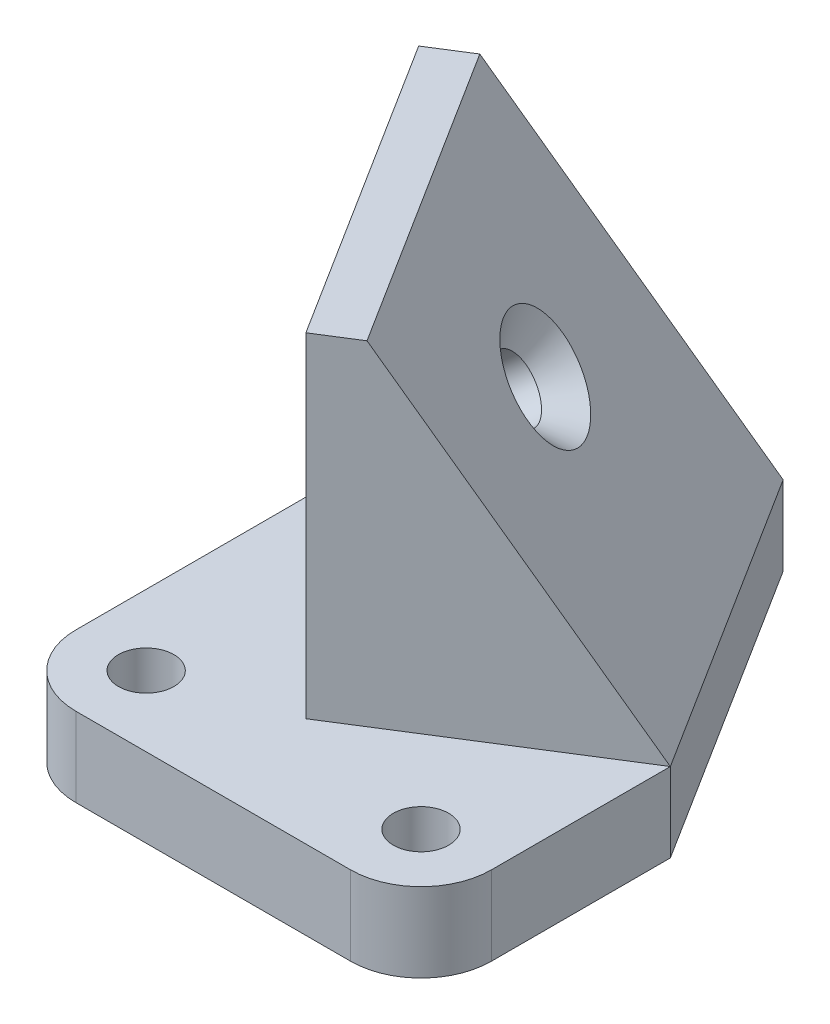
ISO-10303-21;
HEADER;
FILE_DESCRIPTION(('STEP AP214'),'2;1');
FILE_NAME('part.step','',(''),(''),'','','');
FILE_SCHEMA(('AUTOMOTIVE_DESIGN { 1 0 10303 214 1 1 1 1 }'));
ENDSEC;
DATA;
#1=APPLICATION_CONTEXT('core data for automotive mechanical design processes');
#2=APPLICATION_PROTOCOL_DEFINITION('international standard','automotive_design',2000,#1);
#3=PRODUCT_CONTEXT('',#1,'mechanical');
#4=PRODUCT('Part','Part','',(#3));
#5=PRODUCT_RELATED_PRODUCT_CATEGORY('part','',(#4));
#6=PRODUCT_DEFINITION_FORMATION('','',#4);
#7=PRODUCT_DEFINITION_CONTEXT('part definition',#1,'design');
#8=PRODUCT_DEFINITION('design','',#6,#7);
#9=PRODUCT_DEFINITION_SHAPE('','',#8);
#10=(LENGTH_UNIT() NAMED_UNIT(*) SI_UNIT(.MILLI.,.METRE.));
#11=(NAMED_UNIT(*) PLANE_ANGLE_UNIT() SI_UNIT($,.RADIAN.));
#12=(NAMED_UNIT(*) SI_UNIT($,.STERADIAN.) SOLID_ANGLE_UNIT());
#13=UNCERTAINTY_MEASURE_WITH_UNIT(LENGTH_MEASURE(1.E-05),#10,'distance_accuracy_value','');
#14=(GEOMETRIC_REPRESENTATION_CONTEXT(3) GLOBAL_UNCERTAINTY_ASSIGNED_CONTEXT((#13)) GLOBAL_UNIT_ASSIGNED_CONTEXT((#10,
#11,#12)) REPRESENTATION_CONTEXT('',''));
#15=CARTESIAN_POINT('',(0.,0.,0.));
#16=DIRECTION('',(0.,0.,1.));
#17=DIRECTION('',(1.,0.,0.));
#18=AXIS2_PLACEMENT_3D('',#15,#16,#17);
#19=CARTESIAN_POINT('',(0.,14.2875,-45.));
#20=DIRECTION('',(-0.846153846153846,0.,0.532938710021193));
#21=DIRECTION('',(0.532938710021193,0.,0.846153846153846));
#22=AXIS2_PLACEMENT_3D('',#19,#20,#21);
#23=PLANE('',#22);
#24=DIRECTION('',(-0.532938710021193,0.,-0.846153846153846));
#25=VECTOR('',#24,1.);
#26=CARTESIAN_POINT('',(0.,14.2875,-45.));
#27=LINE('',#26,#25);
#28=CARTESIAN_POINT('',(0.,14.2875,-45.));
#29=VERTEX_POINT('',#28);
#30=CARTESIAN_POINT('',(-34.6410161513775,14.2875,-100.));
#31=VERTEX_POINT('',#30);
#32=EDGE_CURVE('E291',#29,#31,#27,.T.);
#33=ORIENTED_EDGE('',*,*,#32,.F.);
#34=DIRECTION('',(0.,-1.,0.));
#35=VECTOR('',#34,1.);
#36=CARTESIAN_POINT('',(0.,14.2875,-45.));
#37=LINE('',#36,#35);
#38=CARTESIAN_POINT('',(0.,0.,-45.));
#39=VERTEX_POINT('',#38);
#40=EDGE_CURVE('E144',#29,#39,#37,.T.);
#41=ORIENTED_EDGE('',*,*,#40,.T.);
#42=DIRECTION('',(-0.532938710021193,0.,-0.846153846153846));
#43=VECTOR('',#42,1.);
#44=CARTESIAN_POINT('',(0.,0.,-45.));
#45=LINE('',#44,#43);
#46=CARTESIAN_POINT('',(-34.6410161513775,0.,-100.));
#47=VERTEX_POINT('',#46);
#48=EDGE_CURVE('E237',#39,#47,#45,.T.);
#49=ORIENTED_EDGE('',*,*,#48,.T.);
#50=DIRECTION('',(0.,-1.,0.));
#51=VECTOR('',#50,1.);
#52=CARTESIAN_POINT('',(-34.6410161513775,14.2875,-100.));
#53=LINE('',#52,#51);
#54=EDGE_CURVE('E150',#31,#47,#53,.T.);
#55=ORIENTED_EDGE('',*,*,#54,.F.);
#56=EDGE_LOOP('',(#33,#41,#49,#55));
#57=FACE_BOUND('',#56,.T.);
#58=ADVANCED_FACE('F41',(#57),#23,.F.);
#59=CARTESIAN_POINT('',(-34.6410161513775,14.2875,-100.));
#60=DIRECTION('',(0.532938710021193,0.,0.846153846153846));
#61=DIRECTION('',(0.846153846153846,0.,-0.532938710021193));
#62=AXIS2_PLACEMENT_3D('',#59,#60,#61);
#63=PLANE('',#62);
#64=DIRECTION('',(-0.46513764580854,0.835356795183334,0.292960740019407));
#65=VECTOR('',#64,1.);
#66=CARTESIAN_POINT('',(-34.6410161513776,14.2875,-100.));
#67=LINE('',#66,#65);
#68=CARTESIAN_POINT('',(-68.2307692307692,74.6125,-78.8439422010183));
#69=VERTEX_POINT('',#68);
#70=EDGE_CURVE('E298',#31,#69,#67,.T.);
#71=ORIENTED_EDGE('',*,*,#70,.F.);
#72=ORIENTED_EDGE('',*,*,#54,.T.);
#73=DIRECTION('',(-0.846153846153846,0.,0.532938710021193));
#74=VECTOR('',#73,1.);
#75=CARTESIAN_POINT('',(-34.6410161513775,0.,-100.));
#76=LINE('',#75,#74);
#77=CARTESIAN_POINT('',(-75.,0.,-74.5804325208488));
#78=VERTEX_POINT('',#77);
#79=EDGE_CURVE('E242',#47,#78,#76,.T.);
#80=ORIENTED_EDGE('',*,*,#79,.T.);
#81=DIRECTION('',(0.,-1.,0.));
#82=VECTOR('',#81,1.);
#83=CARTESIAN_POINT('',(-75.,14.2875,-74.5804325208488));
#84=LINE('',#83,#82);
#85=CARTESIAN_POINT('',(-75.,14.2875,-74.5804325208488));
#86=VERTEX_POINT('',#85);
#87=EDGE_CURVE('E151',#86,#78,#84,.T.);
#88=ORIENTED_EDGE('',*,*,#87,.F.);
#89=DIRECTION('',(0.,-1.,0.));
#90=VECTOR('',#89,1.);
#91=CARTESIAN_POINT('',(-75.,74.6125,-74.5804325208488));
#92=LINE('',#91,#90);
#93=CARTESIAN_POINT('',(-75.,74.6125,-74.5804325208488));
#94=VERTEX_POINT('',#93);
#95=EDGE_CURVE('E260',#94,#86,#92,.T.);
#96=ORIENTED_EDGE('',*,*,#95,.F.);
#97=DIRECTION('',(-0.846153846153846,0.,0.532938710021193));
#98=VECTOR('',#97,1.);
#99=CARTESIAN_POINT('',(-34.6410161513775,74.6125,-100.));
#100=LINE('',#99,#98);
#101=EDGE_CURVE('E310',#69,#94,#100,.T.);
#102=ORIENTED_EDGE('',*,*,#101,.F.);
#103=EDGE_LOOP('',(#71,#72,#80,#88,#96,#102));
#104=FACE_BOUND('',#103,.T.);
#105=ADVANCED_FACE('F186',(#104),#63,.F.);
#106=CARTESIAN_POINT('',(0.,74.6125,-45.));
#107=DIRECTION('',(0.532938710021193,0.,0.846153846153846));
#108=DIRECTION('',(0.846153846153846,0.,-0.532938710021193));
#109=AXIS2_PLACEMENT_3D('',#106,#107,#108);
#110=PLANE('',#109);
#111=DIRECTION('',(-0.846153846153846,0.,0.532938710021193));
#112=VECTOR('',#111,1.);
#113=CARTESIAN_POINT('',(0.,14.2875,-45.));
#114=LINE('',#113,#112);
#115=CARTESIAN_POINT('',(-40.3589838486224,14.2875,-19.5804325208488));
#116=VERTEX_POINT('',#115);
#117=EDGE_CURVE('E297',#29,#116,#114,.T.);
#118=ORIENTED_EDGE('',*,*,#117,.F.);
#119=DIRECTION('',(0.46513764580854,-0.835356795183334,-0.292960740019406));
#120=VECTOR('',#119,1.);
#121=CARTESIAN_POINT('',(-33.5897530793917,74.6125,-23.8439422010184));
#122=LINE('',#121,#120);
#123=CARTESIAN_POINT('',(-33.5897530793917,74.6125,-23.8439422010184));
#124=VERTEX_POINT('',#123);
#125=EDGE_CURVE('E286',#124,#29,#122,.T.);
#126=ORIENTED_EDGE('',*,*,#125,.F.);
#127=DIRECTION('',(-0.846153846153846,0.,0.532938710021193));
#128=VECTOR('',#127,1.);
#129=CARTESIAN_POINT('',(0.,74.6125,-45.));
#130=LINE('',#129,#128);
#131=CARTESIAN_POINT('',(-40.3589838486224,74.6125,-19.5804325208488));
#132=VERTEX_POINT('',#131);
#133=EDGE_CURVE('E301',#124,#132,#130,.T.);
#134=ORIENTED_EDGE('',*,*,#133,.T.);
#135=DIRECTION('',(0.,-1.,0.));
#136=VECTOR('',#135,1.);
#137=CARTESIAN_POINT('',(-40.3589838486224,74.6125,-19.5804325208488));
#138=LINE('',#137,#136);
#139=EDGE_CURVE('E307',#132,#116,#138,.T.);
#140=ORIENTED_EDGE('',*,*,#139,.T.);
#141=EDGE_LOOP('',(#118,#126,#134,#140));
#142=FACE_BOUND('',#141,.T.);
#143=ADVANCED_FACE('F177',(#142),#110,.T.);
#144=CARTESIAN_POINT('',(0.,74.6125,-45.));
#145=DIRECTION('',(0.,-1.,0.));
#146=DIRECTION('',(0.,0.,-1.));
#147=AXIS2_PLACEMENT_3D('',#144,#145,#146);
#148=PLANE('',#147);
#149=DIRECTION('',(-0.532938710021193,0.,-0.846153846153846));
#150=VECTOR('',#149,1.);
#151=CARTESIAN_POINT('',(-33.5897530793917,74.6125,-23.8439422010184));
#152=LINE('',#151,#150);
#153=EDGE_CURVE('E290',#124,#69,#152,.T.);
#154=ORIENTED_EDGE('',*,*,#153,.T.);
#155=ORIENTED_EDGE('',*,*,#101,.T.);
#156=DIRECTION('',(0.532938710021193,0.,0.846153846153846));
#157=VECTOR('',#156,1.);
#158=CARTESIAN_POINT('',(-75.,74.6125,-74.5804325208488));
#159=LINE('',#158,#157);
#160=EDGE_CURVE('E303',#94,#132,#159,.T.);
#161=ORIENTED_EDGE('',*,*,#160,.T.);
#162=ORIENTED_EDGE('',*,*,#133,.F.);
#163=EDGE_LOOP('',(#154,#155,#161,#162));
#164=FACE_BOUND('',#163,.T.);
#165=ADVANCED_FACE('F176',(#164),#148,.F.);
#166=CARTESIAN_POINT('',(0.,14.2875,0.));
#167=DIRECTION('',(0.,0.,1.));
#168=DIRECTION('',(1.,0.,0.));
#169=AXIS2_PLACEMENT_3D('',#166,#167,#168);
#170=PLANE('',#169);
#171=DIRECTION('',(-1.,0.,0.));
#172=VECTOR('',#171,1.);
#173=CARTESIAN_POINT('',(0.,0.,0.));
#174=LINE('',#173,#172);
#175=CARTESIAN_POINT('',(-12.7,0.,0.));
#176=VERTEX_POINT('',#175);
#177=CARTESIAN_POINT('',(-62.3,0.,0.));
#178=VERTEX_POINT('',#177);
#179=EDGE_CURVE('E251',#176,#178,#174,.T.);
#180=ORIENTED_EDGE('',*,*,#179,.F.);
#181=DIRECTION('',(0.,-1.,0.));
#182=VECTOR('',#181,1.);
#183=CARTESIAN_POINT('',(-12.7,14.2875,0.));
#184=LINE('',#183,#182);
#185=CARTESIAN_POINT('',(-12.7,14.2875,0.));
#186=VERTEX_POINT('',#185);
#187=EDGE_CURVE('E214',#176,#186,#184,.F.);
#188=ORIENTED_EDGE('',*,*,#187,.T.);
#189=DIRECTION('',(-1.,0.,0.));
#190=VECTOR('',#189,1.);
#191=CARTESIAN_POINT('',(0.,14.2875,0.));
#192=LINE('',#191,#190);
#193=CARTESIAN_POINT('',(-62.3,14.2875,0.));
#194=VERTEX_POINT('',#193);
#195=EDGE_CURVE('E239',#186,#194,#192,.T.);
#196=ORIENTED_EDGE('',*,*,#195,.T.);
#197=DIRECTION('',(0.,-1.,0.));
#198=VECTOR('',#197,1.);
#199=CARTESIAN_POINT('',(-62.3,14.2875,0.));
#200=LINE('',#199,#198);
#201=EDGE_CURVE('E223',#194,#178,#200,.T.);
#202=ORIENTED_EDGE('',*,*,#201,.T.);
#203=EDGE_LOOP('',(#180,#188,#196,#202));
#204=FACE_BOUND('',#203,.T.);
#205=ADVANCED_FACE('F178',(#204),#170,.T.);
#206=CARTESIAN_POINT('',(0.,14.2875,0.));
#207=DIRECTION('',(-1.,0.,0.));
#208=DIRECTION('',(0.,0.,1.));
#209=AXIS2_PLACEMENT_3D('',#206,#207,#208);
#210=PLANE('',#209);
#211=DIRECTION('',(0.,0.,-1.));
#212=VECTOR('',#211,1.);
#213=CARTESIAN_POINT('',(0.,14.2875,0.));
#214=LINE('',#213,#212);
#215=CARTESIAN_POINT('',(0.,14.2875,-12.7));
#216=VERTEX_POINT('',#215);
#217=EDGE_CURVE('E233',#216,#29,#214,.T.);
#218=ORIENTED_EDGE('',*,*,#217,.F.);
#219=DIRECTION('',(0.,-1.,0.));
#220=VECTOR('',#219,1.);
#221=CARTESIAN_POINT('',(0.,0.,-12.7));
#222=LINE('',#221,#220);
#223=CARTESIAN_POINT('',(0.,0.,-12.7));
#224=VERTEX_POINT('',#223);
#225=EDGE_CURVE('E139',#216,#224,#222,.T.);
#226=ORIENTED_EDGE('',*,*,#225,.T.);
#227=DIRECTION('',(0.,0.,-1.));
#228=VECTOR('',#227,1.);
#229=CARTESIAN_POINT('',(0.,0.,0.));
#230=LINE('',#229,#228);
#231=EDGE_CURVE('E229',#224,#39,#230,.T.);
#232=ORIENTED_EDGE('',*,*,#231,.T.);
#233=ORIENTED_EDGE('',*,*,#40,.F.);
#234=EDGE_LOOP('',(#218,#226,#232,#233));
#235=FACE_BOUND('',#234,.T.);
#236=ADVANCED_FACE('F187',(#235),#210,.F.);
#237=CARTESIAN_POINT('',(-75.,14.2875,0.));
#238=DIRECTION('',(-1.,0.,0.));
#239=DIRECTION('',(0.,0.,1.));
#240=AXIS2_PLACEMENT_3D('',#237,#238,#239);
#241=PLANE('',#240);
#242=DIRECTION('',(0.,0.,-1.));
#243=VECTOR('',#242,1.);
#244=CARTESIAN_POINT('',(-75.,0.,0.));
#245=LINE('',#244,#243);
#246=CARTESIAN_POINT('',(-75.,0.,-12.7));
#247=VERTEX_POINT('',#246);
#248=EDGE_CURVE('E256',#247,#78,#245,.T.);
#249=ORIENTED_EDGE('',*,*,#248,.F.);
#250=DIRECTION('',(0.,-1.,0.));
#251=VECTOR('',#250,1.);
#252=CARTESIAN_POINT('',(-75.,14.2875,-12.7));
#253=LINE('',#252,#251);
#254=CARTESIAN_POINT('',(-75.,14.2875,-12.7));
#255=VERTEX_POINT('',#254);
#256=EDGE_CURVE('E11',#247,#255,#253,.F.);
#257=ORIENTED_EDGE('',*,*,#256,.T.);
#258=DIRECTION('',(0.,0.,-1.));
#259=VECTOR('',#258,1.);
#260=CARTESIAN_POINT('',(-75.,14.2875,0.));
#261=LINE('',#260,#259);
#262=EDGE_CURVE('E245',#255,#86,#261,.T.);
#263=ORIENTED_EDGE('',*,*,#262,.T.);
#264=ORIENTED_EDGE('',*,*,#87,.T.);
#265=EDGE_LOOP('',(#249,#257,#263,#264));
#266=FACE_BOUND('',#265,.T.);
#267=ADVANCED_FACE('F201',(#266),#241,.T.);
#268=CARTESIAN_POINT('',(0.,14.2875,0.));
#269=DIRECTION('',(0.,-1.,0.));
#270=DIRECTION('',(0.,0.,-1.));
#271=AXIS2_PLACEMENT_3D('',#268,#269,#270);
#272=PLANE('',#271);
#273=CARTESIAN_POINT('',(-12.7,14.2875,-12.7));
#274=DIRECTION('',(0.,1.,0.));
#275=DIRECTION('',(0.,0.,1.));
#276=AXIS2_PLACEMENT_3D('',#273,#274,#275);
#277=CIRCLE('',#276,4.99999999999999);
#278=CARTESIAN_POINT('',(-12.7,14.2875,-7.70000000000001));
#279=VERTEX_POINT('',#278);
#280=EDGE_CURVE('E272',#279,#279,#277,.T.);
#281=ORIENTED_EDGE('',*,*,#280,.F.);
#282=EDGE_LOOP('',(#281));
#283=FACE_BOUND('',#282,.T.);
#284=CARTESIAN_POINT('',(-62.3,14.2875,-12.7));
#285=DIRECTION('',(0.,1.,0.));
#286=DIRECTION('',(0.,0.,1.));
#287=AXIS2_PLACEMENT_3D('',#284,#285,#286);
#288=CIRCLE('',#287,4.99999999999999);
#289=CARTESIAN_POINT('',(-62.3,14.2875,-7.7));
#290=VERTEX_POINT('',#289);
#291=EDGE_CURVE('E274',#290,#290,#288,.T.);
#292=ORIENTED_EDGE('',*,*,#291,.F.);
#293=EDGE_LOOP('',(#292));
#294=FACE_BOUND('',#293,.T.);
#295=ORIENTED_EDGE('',*,*,#195,.F.);
#296=CARTESIAN_POINT('',(-12.7,14.2875,-12.7));
#297=DIRECTION('',(0.,-1.,0.));
#298=DIRECTION('',(0.,0.,-1.));
#299=AXIS2_PLACEMENT_3D('',#296,#297,#298);
#300=CIRCLE('',#299,12.7);
#301=EDGE_CURVE('E47',#186,#216,#300,.F.);
#302=ORIENTED_EDGE('',*,*,#301,.T.);
#303=ORIENTED_EDGE('',*,*,#217,.T.);
#304=ORIENTED_EDGE('',*,*,#117,.T.);
#305=DIRECTION('',(0.532938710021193,0.,0.846153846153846));
#306=VECTOR('',#305,1.);
#307=CARTESIAN_POINT('',(-75.,14.2875,-74.5804325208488));
#308=LINE('',#307,#306);
#309=EDGE_CURVE('E302',#86,#116,#308,.T.);
#310=ORIENTED_EDGE('',*,*,#309,.F.);
#311=ORIENTED_EDGE('',*,*,#262,.F.);
#312=CARTESIAN_POINT('',(-62.3,14.2875,-12.7));
#313=DIRECTION('',(0.,-1.,0.));
#314=DIRECTION('',(0.,0.,-1.));
#315=AXIS2_PLACEMENT_3D('',#312,#313,#314);
#316=CIRCLE('',#315,12.7);
#317=EDGE_CURVE('E61',#255,#194,#316,.F.);
#318=ORIENTED_EDGE('',*,*,#317,.T.);
#319=EDGE_LOOP('',(#295,#302,#303,#304,#310,#311,#318));
#320=FACE_BOUND('',#319,.T.);
#321=ADVANCED_FACE('F204',(#283,#294,#320),#272,.F.);
#322=CARTESIAN_POINT('',(0.,0.,0.));
#323=DIRECTION('',(0.,-1.,0.));
#324=DIRECTION('',(0.,0.,-1.));
#325=AXIS2_PLACEMENT_3D('',#322,#323,#324);
#326=PLANE('',#325);
#327=CARTESIAN_POINT('',(-12.7,0.,-12.7));
#328=DIRECTION('',(0.,1.,0.));
#329=DIRECTION('',(0.,0.,1.));
#330=AXIS2_PLACEMENT_3D('',#327,#328,#329);
#331=CIRCLE('',#330,5.);
#332=CARTESIAN_POINT('',(-12.7,0.,-7.7));
#333=VERTEX_POINT('',#332);
#334=EDGE_CURVE('E276',#333,#333,#331,.T.);
#335=ORIENTED_EDGE('',*,*,#334,.T.);
#336=EDGE_LOOP('',(#335));
#337=FACE_BOUND('',#336,.T.);
#338=CARTESIAN_POINT('',(-62.3,0.,-12.7));
#339=DIRECTION('',(0.,1.,0.));
#340=DIRECTION('',(0.,0.,1.));
#341=AXIS2_PLACEMENT_3D('',#338,#339,#340);
#342=CIRCLE('',#341,5.);
#343=CARTESIAN_POINT('',(-62.3,0.,-7.69999999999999));
#344=VERTEX_POINT('',#343);
#345=EDGE_CURVE('E138',#344,#344,#342,.T.);
#346=ORIENTED_EDGE('',*,*,#345,.T.);
#347=EDGE_LOOP('',(#346));
#348=FACE_BOUND('',#347,.T.);
#349=ORIENTED_EDGE('',*,*,#231,.F.);
#350=CARTESIAN_POINT('',(-12.7,0.,-12.7));
#351=DIRECTION('',(0.,-1.,0.));
#352=DIRECTION('',(0.,0.,-1.));
#353=AXIS2_PLACEMENT_3D('',#350,#351,#352);
#354=CIRCLE('',#353,12.7);
#355=EDGE_CURVE('E225',#224,#176,#354,.T.);
#356=ORIENTED_EDGE('',*,*,#355,.T.);
#357=ORIENTED_EDGE('',*,*,#179,.T.);
#358=CARTESIAN_POINT('',(-62.3,0.,-12.7));
#359=DIRECTION('',(0.,-1.,0.));
#360=DIRECTION('',(0.,0.,-1.));
#361=AXIS2_PLACEMENT_3D('',#358,#359,#360);
#362=CIRCLE('',#361,12.7);
#363=EDGE_CURVE('E228',#178,#247,#362,.T.);
#364=ORIENTED_EDGE('',*,*,#363,.T.);
#365=ORIENTED_EDGE('',*,*,#248,.T.);
#366=ORIENTED_EDGE('',*,*,#79,.F.);
#367=ORIENTED_EDGE('',*,*,#48,.F.);
#368=EDGE_LOOP('',(#349,#356,#357,#364,#365,#366,#367));
#369=FACE_BOUND('',#368,.T.);
#370=ADVANCED_FACE('F234',(#337,#348,#369),#326,.T.);
#371=CARTESIAN_POINT('',(-75.,74.6125,-74.5804325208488));
#372=DIRECTION('',(0.846153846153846,0.,-0.532938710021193));
#373=DIRECTION('',(-0.532938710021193,0.,-0.846153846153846));
#374=AXIS2_PLACEMENT_3D('',#371,#372,#373);
#375=PLANE('',#374);
#376=CARTESIAN_POINT('',(-56.739118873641,40.5834786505,-45.5873897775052));
#377=CARTESIAN_POINT('',(-56.7606127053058,40.5376919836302,-45.6215158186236));
#378=CARTESIAN_POINT('',(-56.7832772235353,40.4923245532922,-45.657500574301));
#379=CARTESIAN_POINT('',(-56.8327758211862,40.4073182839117,-45.7360901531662));
#380=CARTESIAN_POINT('',(-56.8597228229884,40.367917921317,-45.7788742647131));
#381=CARTESIAN_POINT('',(-56.901423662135,40.322170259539,-45.8450832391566));
#382=CARTESIAN_POINT('',(-56.9142389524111,40.3098705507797,-45.8654302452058));
#383=CARTESIAN_POINT('',(-56.9406235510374,40.2889971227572,-45.9073214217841));
#384=CARTESIAN_POINT('',(-56.9541872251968,40.280398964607,-45.9288566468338));
#385=CARTESIAN_POINT('',(-56.9821274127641,40.267702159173,-45.97321765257));
#386=CARTESIAN_POINT('',(-56.9965126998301,40.2636687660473,-45.9960573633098));
#387=CARTESIAN_POINT('',(-57.0254372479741,40.260983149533,-46.041981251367));
#388=CARTESIAN_POINT('',(-57.0399765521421,40.2623324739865,-46.0650654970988));
#389=CARTESIAN_POINT('',(-57.0668925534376,40.2696956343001,-46.1078003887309));
#390=CARTESIAN_POINT('',(-57.0793174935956,40.2751232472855,-46.1275276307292));
#391=CARTESIAN_POINT('',(-57.1036035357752,40.2893347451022,-46.1660869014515));
#392=CARTESIAN_POINT('',(-57.1154642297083,40.298121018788,-46.1849182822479));
#393=CARTESIAN_POINT('',(-57.1469502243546,40.3257198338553,-46.234909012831));
#394=CARTESIAN_POINT('',(-57.16591128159,40.3471658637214,-46.2650137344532));
#395=CARTESIAN_POINT('',(-57.2020266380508,40.3949911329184,-46.3223545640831));
#396=CARTESIAN_POINT('',(-57.2191703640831,40.4213970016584,-46.3495738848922));
#397=CARTESIAN_POINT('',(-57.2479208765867,40.4703833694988,-46.3952214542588));
#398=CARTESIAN_POINT('',(-57.2598525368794,40.4923077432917,-46.4141655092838));
#399=CARTESIAN_POINT('',(-57.2828646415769,40.5371836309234,-46.4507021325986));
#400=CARTESIAN_POINT('',(-57.293953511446,40.5601198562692,-46.4683080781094));
#401=CARTESIAN_POINT('',(-57.3047628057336,40.5834786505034,-46.4854701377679));
#402=B_SPLINE_CURVE_WITH_KNOTS('',3,(#376,#377,#378,#379,#380,#381,#382,#383,#384,#385,#386,
#387,#388,#389,#390,#391,#392,#393,#394,#395,#396,#397,#398,#399,#400,#401),.UNSPECIFIED.,.F.,
.F.,(4,2,2,2,2,2,2,2,2,2,2,2,4),(0.,0.184942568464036,0.375988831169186,0.456775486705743,
0.537020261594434,0.61839820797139,0.699799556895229,0.771317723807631,0.842886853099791,
0.966790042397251,1.09137853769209,1.18532929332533,1.2781644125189),.UNSPECIFIED.);
#403=CARTESIAN_POINT('',(-56.7485935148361,40.5632569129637,-45.6024327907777));
#404=VERTEX_POINT('',#403);
#405=CARTESIAN_POINT('',(-57.2952881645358,40.5632569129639,-46.4704271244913));
#406=VERTEX_POINT('',#405);
#407=EDGE_CURVE('E132',#404,#406,#402,.T.);
#408=ORIENTED_EDGE('',*,*,#407,.T.);
#409=CARTESIAN_POINT('',(-57.0219408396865,34.0079357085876,-46.0364299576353));
#410=DIRECTION('',(0.846153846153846,0.,-0.532938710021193));
#411=DIRECTION('',(0.,1.,0.));
#412=AXIS2_PLACEMENT_3D('',#409,#410,#411);
#413=ELLIPSE('',#412,6.58401300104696,5.49999999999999);
#414=EDGE_CURVE('E136',#406,#404,#413,.T.);
#415=ORIENTED_EDGE('',*,*,#414,.T.);
#416=EDGE_LOOP('',(#408,#415));
#417=FACE_BOUND('',#416,.T.);
#418=ORIENTED_EDGE('',*,*,#309,.T.);
#419=ORIENTED_EDGE('',*,*,#139,.F.);
#420=ORIENTED_EDGE('',*,*,#160,.F.);
#421=ORIENTED_EDGE('',*,*,#95,.T.);
#422=EDGE_LOOP('',(#418,#419,#420,#421));
#423=FACE_BOUND('',#422,.T.);
#424=ADVANCED_FACE('F145',(#417,#423),#375,.F.);
#425=CARTESIAN_POINT('',(-33.5897530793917,74.6125,-23.8439422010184));
#426=DIRECTION('',(0.706840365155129,0.549708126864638,-0.445193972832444));
#427=DIRECTION('',(-0.613901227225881,0.789382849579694,0.));
#428=AXIS2_PLACEMENT_3D('',#425,#426,#427);
#429=PLANE('',#428);
#430=CARTESIAN_POINT('',(-36.5210868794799,49.951402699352,-58.9486192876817));
#431=DIRECTION('',(0.706840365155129,0.549708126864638,-0.445193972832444));
#432=DIRECTION('',(-0.613901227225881,0.789382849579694,0.));
#433=AXIS2_PLACEMENT_3D('',#430,#431,#432);
#434=CIRCLE('',#433,10.);
#435=CARTESIAN_POINT('',(-42.6600991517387,57.845231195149,-58.9486192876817));
#436=VERTEX_POINT('',#435);
#437=EDGE_CURVE('E288',#436,#436,#434,.T.);
#438=ORIENTED_EDGE('',*,*,#437,.F.);
#439=EDGE_LOOP('',(#438));
#440=FACE_BOUND('',#439,.T.);
#441=ORIENTED_EDGE('',*,*,#32,.T.);
#442=ORIENTED_EDGE('',*,*,#70,.T.);
#443=ORIENTED_EDGE('',*,*,#153,.F.);
#444=ORIENTED_EDGE('',*,*,#125,.T.);
#445=EDGE_LOOP('',(#441,#442,#443,#444));
#446=FACE_BOUND('',#445,.T.);
#447=ADVANCED_FACE('F166',(#440,#446),#429,.T.);
#448=CARTESIAN_POINT('',(-36.5210868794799,49.951402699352,-58.9486192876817));
#449=DIRECTION('',(0.706840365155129,0.549708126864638,-0.445193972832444));
#450=DIRECTION('',(-0.613901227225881,0.789382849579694,0.));
#451=AXIS2_PLACEMENT_3D('',#448,#449,#450);
#452=CYLINDRICAL_SURFACE('',#451,5.49999999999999);
#453=CARTESIAN_POINT('',(-39.701868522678,47.4777161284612,-56.9452464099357));
#454=DIRECTION('',(0.706840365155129,0.549708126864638,-0.445193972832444));
#455=DIRECTION('',(-0.613901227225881,0.789382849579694,0.));
#456=AXIS2_PLACEMENT_3D('',#453,#454,#455);
#457=CIRCLE('',#456,5.5);
#458=CARTESIAN_POINT('',(-43.0783252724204,51.8193218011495,-56.9452464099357));
#459=VERTEX_POINT('',#458);
#460=EDGE_CURVE('E135',#459,#459,#457,.T.);
#461=ORIENTED_EDGE('',*,*,#460,.T.);
#462=EDGE_LOOP('',(#461));
#463=FACE_BOUND('',#462,.T.);
#464=CARTESIAN_POINT('',(-54.4748321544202,35.9888162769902,-47.6406923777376));
#465=DIRECTION('',(0.706840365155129,0.549708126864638,-0.445193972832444));
#466=DIRECTION('',(-0.613901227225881,0.789382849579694,0.));
#467=AXIS2_PLACEMENT_3D('',#464,#465,#466);
#468=CIRCLE('',#467,5.5);
#469=EDGE_CURVE('E128',#404,#406,#468,.T.);
#470=ORIENTED_EDGE('',*,*,#469,.F.);
#471=ORIENTED_EDGE('',*,*,#414,.F.);
#472=EDGE_LOOP('',(#470,#471));
#473=FACE_BOUND('',#472,.T.);
#474=ADVANCED_FACE('F126',(#463,#473),#452,.F.);
#475=CARTESIAN_POINT('',(-54.4748321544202,35.9888162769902,-47.6406923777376));
#476=DIRECTION('',(0.706840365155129,0.549708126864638,-0.445193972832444));
#477=DIRECTION('',(-0.613901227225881,0.789382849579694,0.));
#478=AXIS2_PLACEMENT_3D('',#475,#476,#477);
#479=CONICAL_SURFACE('',#478,5.49999999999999,1.02974425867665);
#480=CARTESIAN_POINT('',(-56.8107511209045,34.1721774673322,-46.1694449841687));
#481=VERTEX_POINT('',#480);
#482=VERTEX_LOOP('',#481);
#483=FACE_BOUND('',#482,.T.);
#484=ORIENTED_EDGE('',*,*,#469,.T.);
#485=ORIENTED_EDGE('',*,*,#407,.F.);
#486=EDGE_LOOP('',(#484,#485));
#487=FACE_BOUND('',#486,.T.);
#488=ADVANCED_FACE('F125',(#483,#487),#479,.F.);
#489=CARTESIAN_POINT('',(-36.5210868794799,49.951402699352,-58.9486192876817));
#490=DIRECTION('',(0.706840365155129,0.549708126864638,-0.445193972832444));
#491=DIRECTION('',(-0.613901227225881,0.789382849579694,0.));
#492=AXIS2_PLACEMENT_3D('',#489,#490,#491);
#493=CONICAL_SURFACE('',#492,10.,0.785398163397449);
#494=ORIENTED_EDGE('',*,*,#460,.F.);
#495=EDGE_LOOP('',(#494));
#496=FACE_BOUND('',#495,.T.);
#497=ORIENTED_EDGE('',*,*,#437,.T.);
#498=EDGE_LOOP('',(#497));
#499=FACE_BOUND('',#498,.T.);
#500=ADVANCED_FACE('F123',(#496,#499),#493,.F.);
#501=CARTESIAN_POINT('',(-12.7,14.2875,-12.7));
#502=DIRECTION('',(0.,1.,0.));
#503=DIRECTION('',(0.,0.,1.));
#504=AXIS2_PLACEMENT_3D('',#501,#502,#503);
#505=CYLINDRICAL_SURFACE('',#504,12.7);
#506=ORIENTED_EDGE('',*,*,#301,.F.);
#507=ORIENTED_EDGE('',*,*,#187,.F.);
#508=ORIENTED_EDGE('',*,*,#355,.F.);
#509=ORIENTED_EDGE('',*,*,#225,.F.);
#510=EDGE_LOOP('',(#506,#507,#508,#509));
#511=FACE_BOUND('',#510,.T.);
#512=ADVANCED_FACE('F175',(#511),#505,.T.);
#513=CARTESIAN_POINT('',(-62.3,14.2875,-12.7));
#514=DIRECTION('',(0.,-1.,0.));
#515=DIRECTION('',(0.,0.,-1.));
#516=AXIS2_PLACEMENT_3D('',#513,#514,#515);
#517=CYLINDRICAL_SURFACE('',#516,12.7);
#518=ORIENTED_EDGE('',*,*,#317,.F.);
#519=ORIENTED_EDGE('',*,*,#256,.F.);
#520=ORIENTED_EDGE('',*,*,#363,.F.);
#521=ORIENTED_EDGE('',*,*,#201,.F.);
#522=EDGE_LOOP('',(#518,#519,#520,#521));
#523=FACE_BOUND('',#522,.T.);
#524=ADVANCED_FACE('F43',(#523),#517,.T.);
#525=CARTESIAN_POINT('',(-62.3,14.2875,-12.7));
#526=DIRECTION('',(0.,1.,0.));
#527=DIRECTION('',(0.,0.,1.));
#528=AXIS2_PLACEMENT_3D('',#525,#526,#527);
#529=CYLINDRICAL_SURFACE('',#528,4.99999999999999);
#530=ORIENTED_EDGE('',*,*,#345,.F.);
#531=EDGE_LOOP('',(#530));
#532=FACE_BOUND('',#531,.T.);
#533=ORIENTED_EDGE('',*,*,#291,.T.);
#534=EDGE_LOOP('',(#533));
#535=FACE_BOUND('',#534,.T.);
#536=ADVANCED_FACE('F165',(#532,#535),#529,.F.);
#537=CARTESIAN_POINT('',(-12.7,14.2875,-12.7));
#538=DIRECTION('',(0.,1.,0.));
#539=DIRECTION('',(0.,0.,1.));
#540=AXIS2_PLACEMENT_3D('',#537,#538,#539);
#541=CYLINDRICAL_SURFACE('',#540,4.99999999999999);
#542=ORIENTED_EDGE('',*,*,#334,.F.);
#543=EDGE_LOOP('',(#542));
#544=FACE_BOUND('',#543,.T.);
#545=ORIENTED_EDGE('',*,*,#280,.T.);
#546=EDGE_LOOP('',(#545));
#547=FACE_BOUND('',#546,.T.);
#548=ADVANCED_FACE('F366',(#544,#547),#541,.F.);
#549=CLOSED_SHELL('',(#58,#105,#143,#165,#205,#236,#267,#321,#370,#424,#447,#474,#488,#500,#512,
#524,#536,#548));
#550=MANIFOLD_SOLID_BREP('B2',#549);
#551=ADVANCED_BREP_SHAPE_REPRESENTATION('',(#18,#550),#14);
#552=SHAPE_DEFINITION_REPRESENTATION(#9,#551);
ENDSEC;
END-ISO-10303-21;
